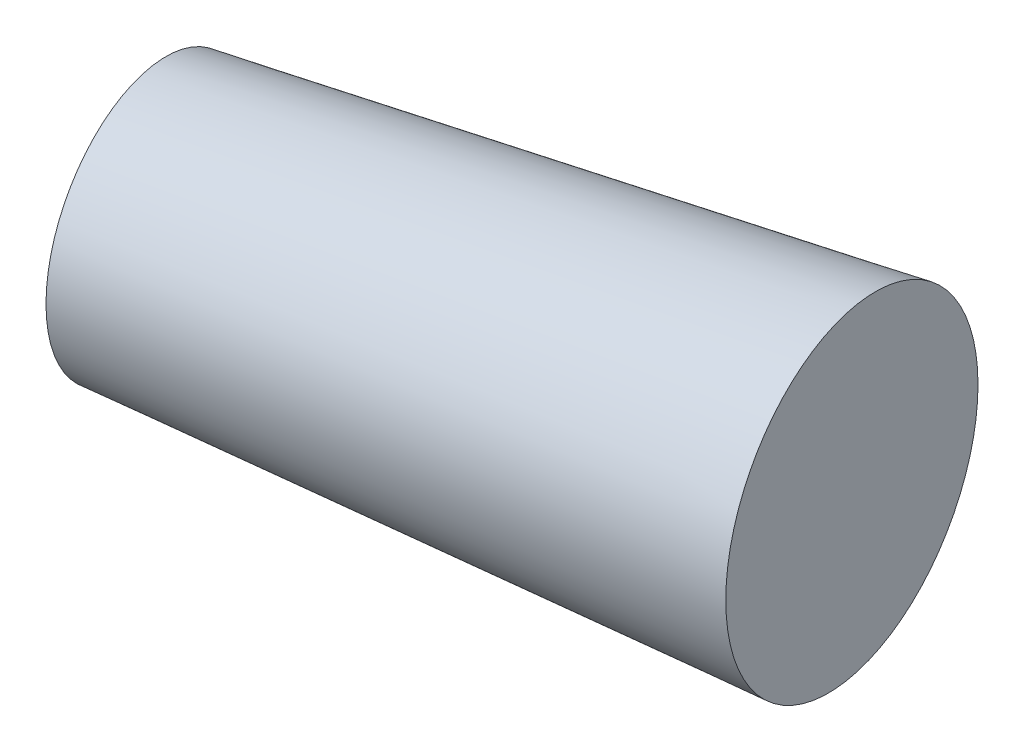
from build123d import *


with BuildPart() as part:
    # Esquisse1 → Base-R_volution (revolve)
    with BuildSketch(Plane(origin=(0, 0, 0), x_dir=(1, 0, 0), z_dir=(0, 1, 0)), mode=Mode.PRIVATE) as base_r_volution_sk:
        Polygon((-6.217658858, -1.203417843), (3.977439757, 0.76982705), (3.454879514, 3.469721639), (-6.636805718, 0.962174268), align=None)
    revolve(base_r_volution_sk.sketch.rotate(Axis((0, 0, 0), (0.9817798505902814, 0, -0.19002190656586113)), 180), axis=Axis((0, 0, 0), (0.9817798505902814, 0, -0.19002190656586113)))


solid = part.part
